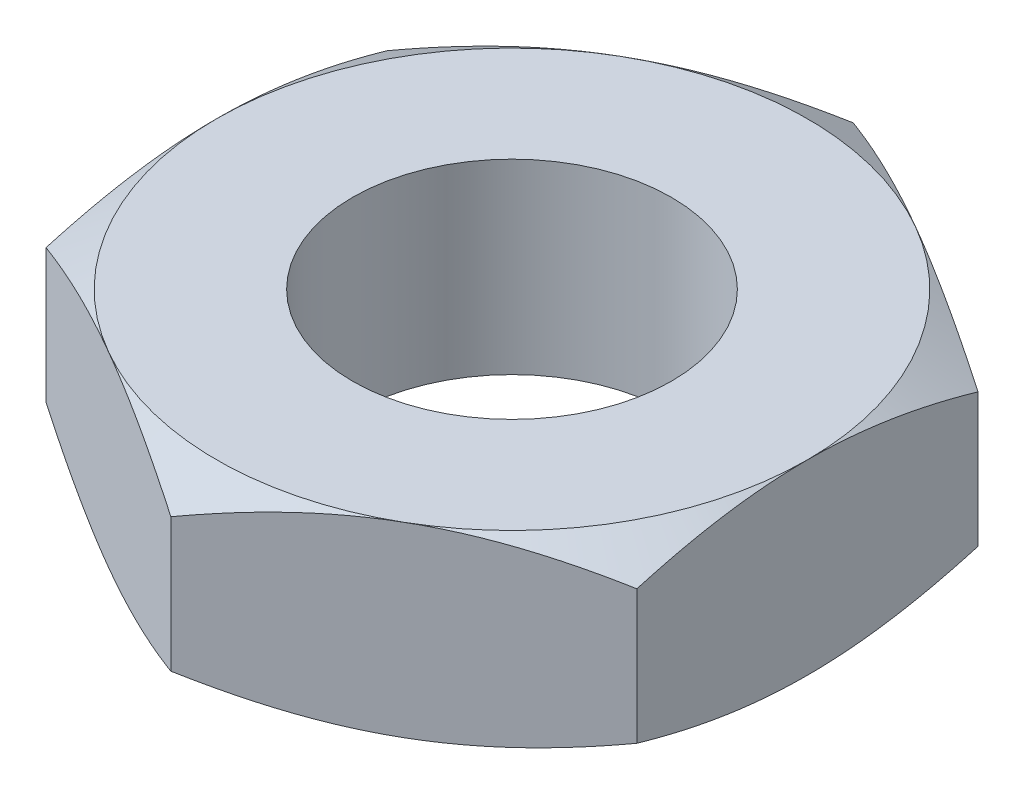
ISO-10303-21;
HEADER;
FILE_DESCRIPTION(('STEP AP214'),'2;1');
FILE_NAME('part.step','',(''),(''),'','','');
FILE_SCHEMA(('AUTOMOTIVE_DESIGN { 1 0 10303 214 1 1 1 1 }'));
ENDSEC;
DATA;
#1=APPLICATION_CONTEXT('core data for automotive mechanical design processes');
#2=APPLICATION_PROTOCOL_DEFINITION('international standard','automotive_design',2000,#1);
#3=PRODUCT_CONTEXT('',#1,'mechanical');
#4=PRODUCT('Part','Part','',(#3));
#5=PRODUCT_RELATED_PRODUCT_CATEGORY('part','',(#4));
#6=PRODUCT_DEFINITION_FORMATION('','',#4);
#7=PRODUCT_DEFINITION_CONTEXT('part definition',#1,'design');
#8=PRODUCT_DEFINITION('design','',#6,#7);
#9=PRODUCT_DEFINITION_SHAPE('','',#8);
#10=(LENGTH_UNIT() NAMED_UNIT(*) SI_UNIT(.MILLI.,.METRE.));
#11=(NAMED_UNIT(*) PLANE_ANGLE_UNIT() SI_UNIT($,.RADIAN.));
#12=(NAMED_UNIT(*) SI_UNIT($,.STERADIAN.) SOLID_ANGLE_UNIT());
#13=UNCERTAINTY_MEASURE_WITH_UNIT(LENGTH_MEASURE(1.E-05),#10,'distance_accuracy_value','');
#14=(GEOMETRIC_REPRESENTATION_CONTEXT(3) GLOBAL_UNCERTAINTY_ASSIGNED_CONTEXT((#13)) GLOBAL_UNIT_ASSIGNED_CONTEXT((#10,
#11,#12)) REPRESENTATION_CONTEXT('',''));
#15=CARTESIAN_POINT('',(0.,0.,0.));
#16=DIRECTION('',(0.,0.,1.));
#17=DIRECTION('',(1.,0.,0.));
#18=AXIS2_PLACEMENT_3D('',#15,#16,#17);
#19=CARTESIAN_POINT('',(0.,0.85359681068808,0.));
#20=DIRECTION('',(0.,1.,0.));
#21=DIRECTION('',(0.,0.,1.));
#22=AXIS2_PLACEMENT_3D('',#19,#20,#21);
#23=CONICAL_SURFACE('',#22,10.9784730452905,1.0471975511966);
#24=CARTESIAN_POINT('',(0.,0.84850577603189,-10.9696551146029));
#25=CARTESIAN_POINT('',(-0.386647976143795,0.719590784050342,-10.7464238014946));
#26=CARTESIAN_POINT('',(-0.77639236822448,0.601482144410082,-10.5214047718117));
#27=CARTESIAN_POINT('',(-1.55931671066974,0.393199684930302,-10.0693831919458));
#28=CARTESIAN_POINT('',(-1.95246935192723,0.302887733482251,-9.84239640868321));
#29=CARTESIAN_POINT('',(-2.545908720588,0.191999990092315,-9.49977402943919));
#30=CARTESIAN_POINT('',(-2.74447148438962,0.159120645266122,-9.38513376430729));
#31=CARTESIAN_POINT('',(-3.14254761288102,0.102205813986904,-9.15530440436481));
#32=CARTESIAN_POINT('',(-3.34206095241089,0.0781700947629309,-9.04011532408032));
#33=CARTESIAN_POINT('',(-3.74277620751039,0.0393648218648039,-8.80876226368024));
#34=CARTESIAN_POINT('',(-3.94398157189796,0.0246423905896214,-8.69259629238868));
#35=CARTESIAN_POINT('',(-4.34678800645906,0.00493960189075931,-8.46003588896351));
#36=CARTESIAN_POINT('',(-4.54838914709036,-3.88261459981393E-05,-8.3436414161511));
#37=CARTESIAN_POINT('',(-4.75,0.,-8.22724133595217));
#38=B_SPLINE_CURVE_WITH_KNOTS('',3,(#24,#25,#26,#27,#28,#29,#30,#31,#32,#33,#34,#35,#36,#37),
.UNSPECIFIED.,.F.,.F.,(4,2,2,2,2,2,4),(0.,1.39466965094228,2.78229242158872,3.47701423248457,
4.17171775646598,4.86990873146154,5.56823793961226),.UNSPECIFIED.);
#39=CARTESIAN_POINT('',(0.,0.848505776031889,-10.9696551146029));
#40=VERTEX_POINT('',#39);
#41=CARTESIAN_POINT('',(-4.75,0.,-8.22724133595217));
#42=VERTEX_POINT('',#41);
#43=EDGE_CURVE('E298',#40,#42,#38,.T.);
#44=ORIENTED_EDGE('',*,*,#43,.F.);
#45=CARTESIAN_POINT('',(4.75,0.,-8.22724133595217));
#46=CARTESIAN_POINT('',(4.54838914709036,-3.88261459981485E-05,-8.3436414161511));
#47=CARTESIAN_POINT('',(4.34678800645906,0.00493960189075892,-8.46003588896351));
#48=CARTESIAN_POINT('',(3.94398157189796,0.0246423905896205,-8.69259629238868));
#49=CARTESIAN_POINT('',(3.74277620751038,0.0393648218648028,-8.80876226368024));
#50=CARTESIAN_POINT('',(3.34206095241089,0.0781700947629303,-9.04011532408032));
#51=CARTESIAN_POINT('',(3.14254761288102,0.102205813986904,-9.15530440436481));
#52=CARTESIAN_POINT('',(2.74447148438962,0.159120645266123,-9.38513376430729));
#53=CARTESIAN_POINT('',(2.545908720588,0.191999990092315,-9.49977402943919));
#54=CARTESIAN_POINT('',(1.95246935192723,0.302887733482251,-9.84239640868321));
#55=CARTESIAN_POINT('',(1.55931671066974,0.393199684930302,-10.0693831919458));
#56=CARTESIAN_POINT('',(0.776392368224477,0.601482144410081,-10.5214047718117));
#57=CARTESIAN_POINT('',(0.386647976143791,0.719590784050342,-10.7464238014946));
#58=CARTESIAN_POINT('',(0.,0.848505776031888,-10.9696551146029));
#59=B_SPLINE_CURVE_WITH_KNOTS('',3,(#45,#46,#47,#48,#49,#50,#51,#52,#53,#54,#55,#56,#57,#58),
.UNSPECIFIED.,.F.,.F.,(4,2,2,2,2,2,4),(0.,0.698329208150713,1.39652018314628,2.09122370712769,
2.78594551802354,4.17356828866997,5.56823793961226),.UNSPECIFIED.);
#60=CARTESIAN_POINT('',(4.75,0.,-8.22724133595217));
#61=VERTEX_POINT('',#60);
#62=EDGE_CURVE('E142',#61,#40,#59,.T.);
#63=ORIENTED_EDGE('',*,*,#62,.F.);
#64=CARTESIAN_POINT('',(0.,0.,0.));
#65=DIRECTION('',(0.,1.,0.));
#66=DIRECTION('',(0.,0.,1.));
#67=AXIS2_PLACEMENT_3D('',#64,#65,#66);
#68=CIRCLE('',#67,9.5);
#69=EDGE_CURVE('E134',#42,#61,#68,.F.);
#70=ORIENTED_EDGE('',*,*,#69,.F.);
#71=EDGE_LOOP('',(#44,#63,#70));
#72=FACE_BOUND('',#71,.T.);
#73=ADVANCED_FACE('F16',(#72),#23,.T.);
#74=CARTESIAN_POINT('',(0.,0.85359681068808,0.));
#75=DIRECTION('',(0.,1.,0.));
#76=DIRECTION('',(0.,0.,1.));
#77=AXIS2_PLACEMENT_3D('',#74,#75,#76);
#78=CONICAL_SURFACE('',#77,10.9784730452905,1.0471975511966);
#79=CARTESIAN_POINT('',(-9.5,0.848505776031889,-5.48482755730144));
#80=CARTESIAN_POINT('',(-9.5,0.719590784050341,-5.03836493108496));
#81=CARTESIAN_POINT('',(-9.5,0.60148214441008,-4.5883268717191));
#82=CARTESIAN_POINT('',(-9.5,0.393199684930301,-3.68428371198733));
#83=CARTESIAN_POINT('',(-9.5,0.30288773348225,-3.23031014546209));
#84=CARTESIAN_POINT('',(-9.5,0.191999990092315,-2.54506538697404));
#85=CARTESIAN_POINT('',(-9.5,0.159120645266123,-2.31578485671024));
#86=CARTESIAN_POINT('',(-9.5,0.102205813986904,-1.8561261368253));
#87=CARTESIAN_POINT('',(-9.5,0.07817009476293,-1.62574797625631));
#88=CARTESIAN_POINT('',(-9.5,0.0393648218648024,-1.16304185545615));
#89=CARTESIAN_POINT('',(-9.5,0.0246423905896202,-0.930709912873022));
#90=CARTESIAN_POINT('',(-9.5,0.00493960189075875,-0.465589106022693));
#91=CARTESIAN_POINT('',(-9.5,-3.88261459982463E-05,-0.232800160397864));
#92=CARTESIAN_POINT('',(-9.5,0.,0.));
#93=B_SPLINE_CURVE_WITH_KNOTS('',3,(#79,#80,#81,#82,#83,#84,#85,#86,#87,#88,#89,#90,#91,#92),
.UNSPECIFIED.,.F.,.F.,(4,2,2,2,2,2,4),(0.,1.39466965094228,2.78229242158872,3.47701423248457,
4.17171775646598,4.86990873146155,5.56823793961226),.UNSPECIFIED.);
#94=CARTESIAN_POINT('',(-9.5,0.848505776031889,-5.48482755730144));
#95=VERTEX_POINT('',#94);
#96=CARTESIAN_POINT('',(-9.5,0.,0.));
#97=VERTEX_POINT('',#96);
#98=EDGE_CURVE('E299',#95,#97,#93,.T.);
#99=ORIENTED_EDGE('',*,*,#98,.F.);
#100=CARTESIAN_POINT('',(-4.75,0.,-8.22724133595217));
#101=CARTESIAN_POINT('',(-4.95161085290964,-3.88261459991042E-05,-8.11084125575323));
#102=CARTESIAN_POINT('',(-5.15321199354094,0.00493960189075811,-7.99444678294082));
#103=CARTESIAN_POINT('',(-5.55601842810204,0.0246423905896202,-7.76188637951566));
#104=CARTESIAN_POINT('',(-5.75722379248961,0.0393648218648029,-7.64572040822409));
#105=CARTESIAN_POINT('',(-6.1579390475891,0.0781700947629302,-7.41436734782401));
#106=CARTESIAN_POINT('',(-6.35745238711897,0.102205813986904,-7.29917826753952));
#107=CARTESIAN_POINT('',(-6.75552851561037,0.159120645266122,-7.06934890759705));
#108=CARTESIAN_POINT('',(-6.95409127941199,0.191999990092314,-6.95470864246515));
#109=CARTESIAN_POINT('',(-7.54753064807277,0.30288773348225,-6.61208626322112));
#110=CARTESIAN_POINT('',(-7.94068328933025,0.393199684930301,-6.3850994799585));
#111=CARTESIAN_POINT('',(-8.72360763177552,0.601482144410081,-5.93307790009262));
#112=CARTESIAN_POINT('',(-9.1133520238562,0.719590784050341,-5.70805887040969));
#113=CARTESIAN_POINT('',(-9.5,0.848505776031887,-5.48482755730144));
#114=B_SPLINE_CURVE_WITH_KNOTS('',3,(#100,#101,#102,#103,#104,#105,#106,#107,#108,#109,#110,
#111,#112,#113),.UNSPECIFIED.,.F.,.F.,(4,2,2,2,2,2,4),(0.,0.698329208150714,1.39652018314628,
2.09122370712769,2.78594551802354,4.17356828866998,5.56823793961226),.UNSPECIFIED.);
#115=EDGE_CURVE('E293',#42,#95,#114,.T.);
#116=ORIENTED_EDGE('',*,*,#115,.F.);
#117=CARTESIAN_POINT('',(0.,0.,0.));
#118=DIRECTION('',(0.,1.,0.));
#119=DIRECTION('',(0.,0.,1.));
#120=AXIS2_PLACEMENT_3D('',#117,#118,#119);
#121=CIRCLE('',#120,9.5);
#122=EDGE_CURVE('E136',#97,#42,#121,.F.);
#123=ORIENTED_EDGE('',*,*,#122,.F.);
#124=EDGE_LOOP('',(#99,#116,#123));
#125=FACE_BOUND('',#124,.T.);
#126=ADVANCED_FACE('F193',(#125),#78,.T.);
#127=CARTESIAN_POINT('',(0.,0.853596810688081,0.));
#128=DIRECTION('',(0.,1.,0.));
#129=DIRECTION('',(-1.,0.,0.));
#130=AXIS2_PLACEMENT_3D('',#127,#128,#129);
#131=CONICAL_SURFACE('',#130,10.9784730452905,1.0471975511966);
#132=CARTESIAN_POINT('',(-9.5,0.84850577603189,5.48482755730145));
#133=CARTESIAN_POINT('',(-9.1133520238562,0.719590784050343,5.70805887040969));
#134=CARTESIAN_POINT('',(-8.72360763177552,0.601482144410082,5.93307790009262));
#135=CARTESIAN_POINT('',(-7.94068328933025,0.393199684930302,6.38509947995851));
#136=CARTESIAN_POINT('',(-7.54753064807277,0.302887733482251,6.61208626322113));
#137=CARTESIAN_POINT('',(-6.95409127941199,0.191999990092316,6.95470864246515));
#138=CARTESIAN_POINT('',(-6.75552851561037,0.159120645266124,7.06934890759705));
#139=CARTESIAN_POINT('',(-6.35745238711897,0.102205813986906,7.29917826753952));
#140=CARTESIAN_POINT('',(-6.1579390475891,0.0781700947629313,7.41436734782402));
#141=CARTESIAN_POINT('',(-5.75722379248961,0.0393648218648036,7.6457204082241));
#142=CARTESIAN_POINT('',(-5.55601842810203,0.0246423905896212,7.76188637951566));
#143=CARTESIAN_POINT('',(-5.15321199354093,0.00493960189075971,7.99444678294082));
#144=CARTESIAN_POINT('',(-4.95161085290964,-3.88261459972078E-05,8.11084125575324));
#145=CARTESIAN_POINT('',(-4.74999999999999,0.,8.22724133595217));
#146=B_SPLINE_CURVE_WITH_KNOTS('',3,(#132,#133,#134,#135,#136,#137,#138,#139,#140,#141,#142,
#143,#144,#145),.UNSPECIFIED.,.F.,.F.,(4,2,2,2,2,2,4),(0.,1.39466965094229,2.78229242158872,
3.47701423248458,4.17171775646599,4.86990873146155,5.56823793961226),.UNSPECIFIED.);
#147=CARTESIAN_POINT('',(-9.5,0.84850577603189,5.48482755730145));
#148=VERTEX_POINT('',#147);
#149=CARTESIAN_POINT('',(-4.75,0.,8.22724133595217));
#150=VERTEX_POINT('',#149);
#151=EDGE_CURVE('E204',#148,#150,#146,.T.);
#152=ORIENTED_EDGE('',*,*,#151,.F.);
#153=CARTESIAN_POINT('',(-9.5,0.,0.));
#154=CARTESIAN_POINT('',(-9.5,-3.88261459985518E-05,0.232800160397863));
#155=CARTESIAN_POINT('',(-9.5,0.00493960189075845,0.465589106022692));
#156=CARTESIAN_POINT('',(-9.5,0.02464239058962,0.930709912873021));
#157=CARTESIAN_POINT('',(-9.5,0.0393648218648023,1.16304185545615));
#158=CARTESIAN_POINT('',(-9.5,0.07817009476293,1.62574797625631));
#159=CARTESIAN_POINT('',(-9.5,0.102205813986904,1.8561261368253));
#160=CARTESIAN_POINT('',(-9.5,0.159120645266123,2.31578485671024));
#161=CARTESIAN_POINT('',(-9.5,0.191999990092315,2.54506538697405));
#162=CARTESIAN_POINT('',(-9.5,0.30288773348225,3.23031014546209));
#163=CARTESIAN_POINT('',(-9.5,0.393199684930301,3.68428371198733));
#164=CARTESIAN_POINT('',(-9.5,0.601482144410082,4.5883268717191));
#165=CARTESIAN_POINT('',(-9.5,0.719590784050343,5.03836493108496));
#166=CARTESIAN_POINT('',(-9.5,0.84850577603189,5.48482755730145));
#167=B_SPLINE_CURVE_WITH_KNOTS('',3,(#153,#154,#155,#156,#157,#158,#159,#160,#161,#162,#163,
#164,#165,#166),.UNSPECIFIED.,.F.,.F.,(4,2,2,2,2,2,4),(0.,0.698329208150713,1.39652018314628,
2.09122370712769,2.78594551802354,4.17356828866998,5.56823793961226),.UNSPECIFIED.);
#168=EDGE_CURVE('E198',#97,#148,#167,.T.);
#169=ORIENTED_EDGE('',*,*,#168,.F.);
#170=CARTESIAN_POINT('',(0.,0.,0.));
#171=DIRECTION('',(0.,1.,0.));
#172=DIRECTION('',(-1.,0.,0.));
#173=AXIS2_PLACEMENT_3D('',#170,#171,#172);
#174=CIRCLE('',#173,9.5);
#175=EDGE_CURVE('E144',#150,#97,#174,.F.);
#176=ORIENTED_EDGE('',*,*,#175,.F.);
#177=EDGE_LOOP('',(#152,#169,#176));
#178=FACE_BOUND('',#177,.T.);
#179=ADVANCED_FACE('F188',(#178),#131,.T.);
#180=CARTESIAN_POINT('',(0.,0.853596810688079,0.));
#181=DIRECTION('',(0.,1.,0.));
#182=DIRECTION('',(-1.,0.,0.));
#183=AXIS2_PLACEMENT_3D('',#180,#181,#182);
#184=CONICAL_SURFACE('',#183,10.9784730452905,1.0471975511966);
#185=CARTESIAN_POINT('',(0.,0.,0.));
#186=DIRECTION('',(0.,1.,0.));
#187=DIRECTION('',(-1.,0.,0.));
#188=AXIS2_PLACEMENT_3D('',#185,#186,#187);
#189=CIRCLE('',#188,9.5);
#190=CARTESIAN_POINT('',(4.75,0.,8.22724133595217));
#191=VERTEX_POINT('',#190);
#192=EDGE_CURVE('E117',#191,#150,#189,.F.);
#193=ORIENTED_EDGE('',*,*,#192,.F.);
#194=CARTESIAN_POINT('',(0.,0.848505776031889,10.9696551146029));
#195=CARTESIAN_POINT('',(0.386647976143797,0.719590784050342,10.7464238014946));
#196=CARTESIAN_POINT('',(0.776392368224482,0.601482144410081,10.5214047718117));
#197=CARTESIAN_POINT('',(1.55931671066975,0.393199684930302,10.0693831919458));
#198=CARTESIAN_POINT('',(1.95246935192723,0.302887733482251,9.84239640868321));
#199=CARTESIAN_POINT('',(2.54590872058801,0.191999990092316,9.49977402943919));
#200=CARTESIAN_POINT('',(2.74447148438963,0.159120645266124,9.38513376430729));
#201=CARTESIAN_POINT('',(3.14254761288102,0.102205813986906,9.15530440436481));
#202=CARTESIAN_POINT('',(3.3420609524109,0.0781700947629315,9.04011532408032));
#203=CARTESIAN_POINT('',(3.74277620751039,0.039364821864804,8.80876226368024));
#204=CARTESIAN_POINT('',(3.94398157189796,0.0246423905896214,8.69259629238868));
#205=CARTESIAN_POINT('',(4.34678800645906,0.00493960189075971,8.46003588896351));
#206=CARTESIAN_POINT('',(4.54838914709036,-3.8826145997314E-05,8.3436414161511));
#207=CARTESIAN_POINT('',(4.75,0.,8.22724133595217));
#208=B_SPLINE_CURVE_WITH_KNOTS('',3,(#194,#195,#196,#197,#198,#199,#200,#201,#202,#203,#204,
#205,#206,#207),.UNSPECIFIED.,.F.,.F.,(4,2,2,2,2,2,4),(0.,1.39466965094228,2.78229242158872,
3.47701423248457,4.17171775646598,4.86990873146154,5.56823793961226),.UNSPECIFIED.);
#209=CARTESIAN_POINT('',(0.,0.848505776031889,10.9696551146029));
#210=VERTEX_POINT('',#209);
#211=EDGE_CURVE('E159',#210,#191,#208,.T.);
#212=ORIENTED_EDGE('',*,*,#211,.F.);
#213=CARTESIAN_POINT('',(-4.74999999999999,0.,8.22724133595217));
#214=CARTESIAN_POINT('',(-4.54838914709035,-3.88261459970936E-05,8.3436414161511));
#215=CARTESIAN_POINT('',(-4.34678800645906,0.00493960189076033,8.46003588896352));
#216=CARTESIAN_POINT('',(-3.94398157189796,0.0246423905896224,8.69259629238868));
#217=CARTESIAN_POINT('',(-3.74277620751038,0.0393648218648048,8.80876226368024));
#218=CARTESIAN_POINT('',(-3.34206095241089,0.0781700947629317,9.04011532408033));
#219=CARTESIAN_POINT('',(-3.14254761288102,0.102205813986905,9.15530440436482));
#220=CARTESIAN_POINT('',(-2.74447148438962,0.159120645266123,9.38513376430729));
#221=CARTESIAN_POINT('',(-2.545908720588,0.191999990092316,9.49977402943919));
#222=CARTESIAN_POINT('',(-1.95246935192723,0.302887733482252,9.84239640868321));
#223=CARTESIAN_POINT('',(-1.55931671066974,0.393199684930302,10.0693831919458));
#224=CARTESIAN_POINT('',(-0.776392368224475,0.601482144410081,10.5214047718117));
#225=CARTESIAN_POINT('',(-0.386647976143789,0.719590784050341,10.7464238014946));
#226=CARTESIAN_POINT('',(0.,0.848505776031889,10.9696551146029));
#227=B_SPLINE_CURVE_WITH_KNOTS('',3,(#213,#214,#215,#216,#217,#218,#219,#220,#221,#222,#223,
#224,#225,#226),.UNSPECIFIED.,.F.,.F.,(4,2,2,2,2,2,4),(0.,0.698329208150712,1.39652018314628,
2.09122370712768,2.78594551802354,4.17356828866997,5.56823793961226),.UNSPECIFIED.);
#228=EDGE_CURVE('E161',#150,#210,#227,.T.);
#229=ORIENTED_EDGE('',*,*,#228,.F.);
#230=EDGE_LOOP('',(#193,#212,#229));
#231=FACE_BOUND('',#230,.T.);
#232=ADVANCED_FACE('F158',(#231),#184,.T.);
#233=CARTESIAN_POINT('',(0.,0.853596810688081,0.));
#234=DIRECTION('',(0.,1.,0.));
#235=DIRECTION('',(-1.,0.,0.));
#236=AXIS2_PLACEMENT_3D('',#233,#234,#235);
#237=CONICAL_SURFACE('',#236,10.9784730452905,1.0471975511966);
#238=CARTESIAN_POINT('',(9.5,0.84850577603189,5.48482755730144));
#239=CARTESIAN_POINT('',(9.5,0.719590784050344,5.03836493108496));
#240=CARTESIAN_POINT('',(9.5,0.601482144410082,4.5883268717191));
#241=CARTESIAN_POINT('',(9.5,0.393199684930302,3.68428371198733));
#242=CARTESIAN_POINT('',(9.5,0.302887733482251,3.23031014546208));
#243=CARTESIAN_POINT('',(9.5,0.191999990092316,2.54506538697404));
#244=CARTESIAN_POINT('',(9.5,0.159120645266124,2.31578485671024));
#245=CARTESIAN_POINT('',(9.5,0.102205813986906,1.8561261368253));
#246=CARTESIAN_POINT('',(9.5,0.0781700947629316,1.62574797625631));
#247=CARTESIAN_POINT('',(9.5,0.0393648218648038,1.16304185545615));
#248=CARTESIAN_POINT('',(9.5,0.0246423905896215,0.930709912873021));
#249=CARTESIAN_POINT('',(9.5,0.0049396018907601,0.465589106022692));
#250=CARTESIAN_POINT('',(9.5,-3.88261459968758E-05,0.232800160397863));
#251=CARTESIAN_POINT('',(9.5,0.,0.));
#252=B_SPLINE_CURVE_WITH_KNOTS('',3,(#238,#239,#240,#241,#242,#243,#244,#245,#246,#247,#248,
#249,#250,#251),.UNSPECIFIED.,.F.,.F.,(4,2,2,2,2,2,4),(0.,1.39466965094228,2.78229242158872,
3.47701423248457,4.17171775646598,4.86990873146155,5.56823793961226),.UNSPECIFIED.);
#253=CARTESIAN_POINT('',(9.5,0.84850577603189,5.48482755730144));
#254=VERTEX_POINT('',#253);
#255=CARTESIAN_POINT('',(9.5,0.,0.));
#256=VERTEX_POINT('',#255);
#257=EDGE_CURVE('E112',#254,#256,#252,.T.);
#258=ORIENTED_EDGE('',*,*,#257,.F.);
#259=CARTESIAN_POINT('',(4.75,0.,8.22724133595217));
#260=CARTESIAN_POINT('',(4.95161085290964,-3.88261459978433E-05,8.11084125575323));
#261=CARTESIAN_POINT('',(5.15321199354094,0.00493960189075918,7.99444678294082));
#262=CARTESIAN_POINT('',(5.55601842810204,0.0246423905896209,7.76188637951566));
#263=CARTESIAN_POINT('',(5.75722379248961,0.0393648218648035,7.64572040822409));
#264=CARTESIAN_POINT('',(6.15793904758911,0.0781700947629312,7.41436734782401));
#265=CARTESIAN_POINT('',(6.35745238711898,0.102205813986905,7.29917826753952));
#266=CARTESIAN_POINT('',(6.75552851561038,0.159120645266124,7.06934890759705));
#267=CARTESIAN_POINT('',(6.954091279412,0.191999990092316,6.95470864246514));
#268=CARTESIAN_POINT('',(7.54753064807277,0.302887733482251,6.61208626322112));
#269=CARTESIAN_POINT('',(7.94068328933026,0.393199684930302,6.3850994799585));
#270=CARTESIAN_POINT('',(8.72360763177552,0.601482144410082,5.93307790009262));
#271=CARTESIAN_POINT('',(9.11335202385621,0.719590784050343,5.70805887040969));
#272=CARTESIAN_POINT('',(9.5,0.84850577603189,5.48482755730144));
#273=B_SPLINE_CURVE_WITH_KNOTS('',3,(#259,#260,#261,#262,#263,#264,#265,#266,#267,#268,#269,
#270,#271,#272),.UNSPECIFIED.,.F.,.F.,(4,2,2,2,2,2,4),(0.,0.698329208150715,1.39652018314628,
2.09122370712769,2.78594551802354,4.17356828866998,5.56823793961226),.UNSPECIFIED.);
#274=EDGE_CURVE('E114',#191,#254,#273,.T.);
#275=ORIENTED_EDGE('',*,*,#274,.F.);
#276=CARTESIAN_POINT('',(0.,0.,0.));
#277=DIRECTION('',(0.,1.,0.));
#278=DIRECTION('',(-1.,0.,0.));
#279=AXIS2_PLACEMENT_3D('',#276,#277,#278);
#280=CIRCLE('',#279,9.5);
#281=EDGE_CURVE('E109',#256,#191,#280,.F.);
#282=ORIENTED_EDGE('',*,*,#281,.F.);
#283=EDGE_LOOP('',(#258,#275,#282));
#284=FACE_BOUND('',#283,.T.);
#285=ADVANCED_FACE('F111',(#284),#237,.T.);
#286=CARTESIAN_POINT('',(0.,0.853596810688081,0.));
#287=DIRECTION('',(0.,1.,0.));
#288=DIRECTION('',(-1.,0.,0.));
#289=AXIS2_PLACEMENT_3D('',#286,#287,#288);
#290=CONICAL_SURFACE('',#289,10.9784730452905,1.0471975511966);
#291=CARTESIAN_POINT('',(9.5,0.848505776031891,-5.48482755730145));
#292=CARTESIAN_POINT('',(9.11335202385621,0.719590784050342,-5.70805887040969));
#293=CARTESIAN_POINT('',(8.72360763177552,0.601482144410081,-5.93307790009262));
#294=CARTESIAN_POINT('',(7.94068328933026,0.393199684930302,-6.3850994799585));
#295=CARTESIAN_POINT('',(7.54753064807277,0.302887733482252,-6.61208626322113));
#296=CARTESIAN_POINT('',(6.95409127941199,0.191999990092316,-6.95470864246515));
#297=CARTESIAN_POINT('',(6.75552851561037,0.159120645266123,-7.06934890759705));
#298=CARTESIAN_POINT('',(6.35745238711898,0.102205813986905,-7.29917826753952));
#299=CARTESIAN_POINT('',(6.1579390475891,0.0781700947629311,-7.41436734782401));
#300=CARTESIAN_POINT('',(5.75722379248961,0.0393648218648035,-7.64572040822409));
#301=CARTESIAN_POINT('',(5.55601842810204,0.0246423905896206,-7.76188637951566));
#302=CARTESIAN_POINT('',(5.15321199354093,0.00493960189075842,-7.99444678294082));
#303=CARTESIAN_POINT('',(4.95161085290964,-3.88261459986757E-05,-8.11084125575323));
#304=CARTESIAN_POINT('',(4.75,0.,-8.22724133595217));
#305=B_SPLINE_CURVE_WITH_KNOTS('',3,(#291,#292,#293,#294,#295,#296,#297,#298,#299,#300,#301,
#302,#303,#304),.UNSPECIFIED.,.F.,.F.,(4,2,2,2,2,2,4),(0.,1.39466965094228,2.78229242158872,
3.47701423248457,4.17171775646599,4.86990873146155,5.56823793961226),.UNSPECIFIED.);
#306=CARTESIAN_POINT('',(9.5,0.84850577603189,-5.48482755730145));
#307=VERTEX_POINT('',#306);
#308=EDGE_CURVE('E126',#307,#61,#305,.T.);
#309=ORIENTED_EDGE('',*,*,#308,.F.);
#310=CARTESIAN_POINT('',(9.5,0.,0.));
#311=CARTESIAN_POINT('',(9.5,-3.88261459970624E-05,-0.232800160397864));
#312=CARTESIAN_POINT('',(9.5,0.00493960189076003,-0.465589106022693));
#313=CARTESIAN_POINT('',(9.5,0.0246423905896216,-0.930709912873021));
#314=CARTESIAN_POINT('',(9.5,0.0393648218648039,-1.16304185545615));
#315=CARTESIAN_POINT('',(9.5,0.0781700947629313,-1.62574797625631));
#316=CARTESIAN_POINT('',(9.5,0.102205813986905,-1.8561261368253));
#317=CARTESIAN_POINT('',(9.5,0.159120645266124,-2.31578485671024));
#318=CARTESIAN_POINT('',(9.5,0.191999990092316,-2.54506538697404));
#319=CARTESIAN_POINT('',(9.5,0.302887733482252,-3.23031014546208));
#320=CARTESIAN_POINT('',(9.5,0.393199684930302,-3.68428371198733));
#321=CARTESIAN_POINT('',(9.5,0.601482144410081,-4.5883268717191));
#322=CARTESIAN_POINT('',(9.5,0.719590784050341,-5.03836493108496));
#323=CARTESIAN_POINT('',(9.5,0.848505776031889,-5.48482755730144));
#324=B_SPLINE_CURVE_WITH_KNOTS('',3,(#310,#311,#312,#313,#314,#315,#316,#317,#318,#319,#320,
#321,#322,#323),.UNSPECIFIED.,.F.,.F.,(4,2,2,2,2,2,4),(0.,0.698329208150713,1.39652018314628,
2.09122370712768,2.78594551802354,4.17356828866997,5.56823793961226),.UNSPECIFIED.);
#325=EDGE_CURVE('E121',#256,#307,#324,.T.);
#326=ORIENTED_EDGE('',*,*,#325,.F.);
#327=CARTESIAN_POINT('',(0.,0.,0.));
#328=DIRECTION('',(0.,1.,0.));
#329=DIRECTION('',(-1.,0.,0.));
#330=AXIS2_PLACEMENT_3D('',#327,#328,#329);
#331=CIRCLE('',#330,9.5);
#332=EDGE_CURVE('E20',#61,#256,#331,.F.);
#333=ORIENTED_EDGE('',*,*,#332,.F.);
#334=EDGE_LOOP('',(#309,#326,#333));
#335=FACE_BOUND('',#334,.T.);
#336=ADVANCED_FACE('F125',(#335),#290,.T.);
#337=CARTESIAN_POINT('',(0.,0.,0.));
#338=DIRECTION('',(0.,-1.,0.));
#339=DIRECTION('',(0.,0.,-1.));
#340=AXIS2_PLACEMENT_3D('',#337,#338,#339);
#341=PLANE('',#340);
#342=ORIENTED_EDGE('',*,*,#122,.T.);
#343=ORIENTED_EDGE('',*,*,#69,.T.);
#344=ORIENTED_EDGE('',*,*,#332,.T.);
#345=ORIENTED_EDGE('',*,*,#281,.T.);
#346=ORIENTED_EDGE('',*,*,#192,.T.);
#347=ORIENTED_EDGE('',*,*,#175,.T.);
#348=EDGE_LOOP('',(#342,#343,#344,#345,#346,#347));
#349=FACE_BOUND('',#348,.T.);
#350=CARTESIAN_POINT('',(0.,0.,0.));
#351=DIRECTION('',(0.,-1.,0.));
#352=DIRECTION('',(0.,0.,-1.));
#353=AXIS2_PLACEMENT_3D('',#350,#351,#352);
#354=CIRCLE('',#353,5.125);
#355=CARTESIAN_POINT('',(0.,0.,-5.125));
#356=VERTEX_POINT('',#355);
#357=EDGE_CURVE('E128',#356,#356,#354,.F.);
#358=ORIENTED_EDGE('',*,*,#357,.T.);
#359=EDGE_LOOP('',(#358));
#360=FACE_BOUND('',#359,.T.);
#361=ADVANCED_FACE('F132',(#349,#360),#341,.T.);
#362=CARTESIAN_POINT('',(9.5,0.,-5.48482755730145));
#363=DIRECTION('',(0.5,0.,-0.866025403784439));
#364=DIRECTION('',(-0.866025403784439,0.,-0.5));
#365=AXIS2_PLACEMENT_3D('',#362,#363,#364);
#366=PLANE('',#365);
#367=ORIENTED_EDGE('',*,*,#308,.T.);
#368=ORIENTED_EDGE('',*,*,#62,.T.);
#369=DIRECTION('',(0.,1.,0.));
#370=VECTOR('',#369,1.);
#371=CARTESIAN_POINT('',(0.,0.,-10.9696551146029));
#372=LINE('',#371,#370);
#373=CARTESIAN_POINT('',(0.,5.15149422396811,-10.9696551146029));
#374=VERTEX_POINT('',#373);
#375=EDGE_CURVE('E306',#374,#40,#372,.F.);
#376=ORIENTED_EDGE('',*,*,#375,.F.);
#377=CARTESIAN_POINT('',(4.75,6.,-8.22724133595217));
#378=CARTESIAN_POINT('',(4.54838914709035,6.000038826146,-8.3436414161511));
#379=CARTESIAN_POINT('',(4.34678800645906,5.99506039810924,-8.46003588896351));
#380=CARTESIAN_POINT('',(3.94398157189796,5.97535760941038,-8.69259629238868));
#381=CARTESIAN_POINT('',(3.74277620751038,5.9606351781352,-8.80876226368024));
#382=CARTESIAN_POINT('',(3.34206095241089,5.92182990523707,-9.04011532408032));
#383=CARTESIAN_POINT('',(3.14254761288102,5.8977941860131,-9.15530440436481));
#384=CARTESIAN_POINT('',(2.74447148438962,5.84087935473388,-9.38513376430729));
#385=CARTESIAN_POINT('',(2.545908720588,5.80800000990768,-9.49977402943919));
#386=CARTESIAN_POINT('',(1.95246935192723,5.69711226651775,-9.84239640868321));
#387=CARTESIAN_POINT('',(1.55931671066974,5.6068003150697,-10.0693831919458));
#388=CARTESIAN_POINT('',(0.776392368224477,5.39851785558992,-10.5214047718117));
#389=CARTESIAN_POINT('',(0.386647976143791,5.28040921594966,-10.7464238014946));
#390=CARTESIAN_POINT('',(0.,5.15149422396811,-10.9696551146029));
#391=B_SPLINE_CURVE_WITH_KNOTS('',3,(#377,#378,#379,#380,#381,#382,#383,#384,#385,#386,#387,
#388,#389,#390),.UNSPECIFIED.,.F.,.F.,(4,2,2,2,2,2,4),(0.,0.698329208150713,1.39652018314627,
2.09122370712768,2.78594551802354,4.17356828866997,5.56823793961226),.UNSPECIFIED.);
#392=CARTESIAN_POINT('',(4.75,6.,-8.22724133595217));
#393=VERTEX_POINT('',#392);
#394=EDGE_CURVE('E395',#393,#374,#391,.T.);
#395=ORIENTED_EDGE('',*,*,#394,.F.);
#396=CARTESIAN_POINT('',(9.50000002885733,5.151494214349,-5.48482754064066));
#397=CARTESIAN_POINT('',(9.11335205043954,5.280409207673,-5.7080588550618));
#398=CARTESIAN_POINT('',(8.72360765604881,5.39851784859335,-5.93307788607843));
#399=CARTESIAN_POINT('',(7.9406833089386,5.60680031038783,-6.38509946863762));
#400=CARTESIAN_POINT('',(7.54753066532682,5.69711226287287,-6.6120862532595));
#401=CARTESIAN_POINT('',(6.95409129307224,5.80800000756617,-6.9547086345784));
#402=CARTESIAN_POINT('',(6.75552852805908,5.84087935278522,-7.06934890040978));
#403=CARTESIAN_POINT('',(6.35745239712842,5.89779418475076,-7.29917826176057));
#404=CARTESIAN_POINT('',(6.15793905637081,5.92182990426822,-7.41436734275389));
#405=CARTESIAN_POINT('',(5.75722379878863,5.960635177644,-7.64572040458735));
#406=CARTESIAN_POINT('',(5.55601843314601,5.97535760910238,-7.76188637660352));
#407=CARTESIAN_POINT('',(5.15321199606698,5.99506039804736,-7.99444678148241));
#408=CARTESIAN_POINT('',(4.95161085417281,6.00003882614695,-8.11084125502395));
#409=CARTESIAN_POINT('',(4.75,6.,-8.22724133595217));
#410=B_SPLINE_CURVE_WITH_KNOTS('',3,(#396,#397,#398,#399,#400,#401,#402,#403,#404,#405,#406,
#407,#408,#409),.UNSPECIFIED.,.F.,.F.,(4,2,2,2,2,2,4),(0.,1.39466965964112,2.78229243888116,
3.4770142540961,4.17171778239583,4.86990876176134,5.56823797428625),.UNSPECIFIED.);
#411=CARTESIAN_POINT('',(9.50000001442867,5.15149421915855,-5.48482754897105));
#412=VERTEX_POINT('',#411);
#413=EDGE_CURVE('E392',#412,#393,#410,.T.);
#414=ORIENTED_EDGE('',*,*,#413,.F.);
#415=DIRECTION('',(0.,1.,0.));
#416=VECTOR('',#415,1.);
#417=CARTESIAN_POINT('',(9.5,0.,-5.48482755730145));
#418=LINE('',#417,#416);
#419=EDGE_CURVE('E165',#307,#412,#418,.T.);
#420=ORIENTED_EDGE('',*,*,#419,.F.);
#421=EDGE_LOOP('',(#367,#368,#376,#395,#414,#420));
#422=FACE_BOUND('',#421,.T.);
#423=ADVANCED_FACE('F284',(#422),#366,.T.);
#424=CARTESIAN_POINT('',(0.,0.,-10.9696551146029));
#425=DIRECTION('',(-0.5,0.,-0.866025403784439));
#426=DIRECTION('',(-0.866025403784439,0.,0.5));
#427=AXIS2_PLACEMENT_3D('',#424,#425,#426);
#428=PLANE('',#427);
#429=ORIENTED_EDGE('',*,*,#43,.T.);
#430=ORIENTED_EDGE('',*,*,#115,.T.);
#431=DIRECTION('',(0.,1.,0.));
#432=VECTOR('',#431,1.);
#433=CARTESIAN_POINT('',(-9.5,0.,-5.48482755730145));
#434=LINE('',#433,#432);
#435=CARTESIAN_POINT('',(-9.5,5.15149421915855,-5.48482757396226));
#436=VERTEX_POINT('',#435);
#437=EDGE_CURVE('E297',#436,#95,#434,.F.);
#438=ORIENTED_EDGE('',*,*,#437,.F.);
#439=CARTESIAN_POINT('',(-4.75,6.,-8.22724133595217));
#440=CARTESIAN_POINT('',(-4.9516108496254,6.00003882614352,-8.11084125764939));
#441=CARTESIAN_POINT('',(-5.15321198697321,5.99506039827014,-7.9944467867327));
#442=CARTESIAN_POINT('',(-5.5560184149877,5.97535761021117,-7.76188638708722));
#443=CARTESIAN_POINT('',(-5.75722377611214,5.9606351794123,-7.64572041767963));
#444=CARTESIAN_POINT('',(-6.15793902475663,5.92182990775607,-7.41436736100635));
#445=CARTESIAN_POINT('',(-6.3574523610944,5.89779418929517,-7.29917828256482));
#446=CARTESIAN_POINT('',(-6.75552848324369,5.8408793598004,-7.06934892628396));
#447=CARTESIAN_POINT('',(-6.95409124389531,5.80800001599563,-6.95470866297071));
#448=CARTESIAN_POINT('',(-7.54753060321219,5.69711227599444,-6.61208628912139));
#449=CARTESIAN_POINT('',(-7.9406832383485,5.60680032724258,-6.38509950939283));
#450=CARTESIAN_POINT('',(-8.72360756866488,5.39851787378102,-5.93307793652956));
#451=CARTESIAN_POINT('',(-9.11335195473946,5.280409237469,-5.70805891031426));
#452=CARTESIAN_POINT('',(-9.49999992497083,5.15149424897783,-5.48482760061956));
#453=B_SPLINE_CURVE_WITH_KNOTS('',3,(#439,#440,#441,#442,#443,#444,#445,#446,#447,#448,#449,
#450,#451,#452),.UNSPECIFIED.,.F.,.F.,(4,2,2,2,2,2,4),(0.,0.698329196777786,1.39652016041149,
2.09122367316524,2.78594547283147,4.1735682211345,5.56823784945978),.UNSPECIFIED.);
#454=CARTESIAN_POINT('',(-4.75,6.,-8.22724133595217));
#455=VERTEX_POINT('',#454);
#456=EDGE_CURVE('E270',#455,#436,#453,.T.);
#457=ORIENTED_EDGE('',*,*,#456,.F.);
#458=CARTESIAN_POINT('',(0.,5.15149422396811,-10.9696551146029));
#459=CARTESIAN_POINT('',(-0.386647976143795,5.28040921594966,-10.7464238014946));
#460=CARTESIAN_POINT('',(-0.77639236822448,5.39851785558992,-10.5214047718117));
#461=CARTESIAN_POINT('',(-1.55931671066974,5.6068003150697,-10.0693831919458));
#462=CARTESIAN_POINT('',(-1.95246935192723,5.69711226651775,-9.84239640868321));
#463=CARTESIAN_POINT('',(-2.54590872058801,5.80800000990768,-9.49977402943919));
#464=CARTESIAN_POINT('',(-2.74447148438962,5.84087935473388,-9.38513376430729));
#465=CARTESIAN_POINT('',(-3.14254761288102,5.89779418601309,-9.15530440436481));
#466=CARTESIAN_POINT('',(-3.34206095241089,5.92182990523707,-9.04011532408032));
#467=CARTESIAN_POINT('',(-3.74277620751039,5.9606351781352,-8.80876226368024));
#468=CARTESIAN_POINT('',(-3.94398157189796,5.97535760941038,-8.69259629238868));
#469=CARTESIAN_POINT('',(-4.34678800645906,5.99506039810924,-8.46003588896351));
#470=CARTESIAN_POINT('',(-4.54838914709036,6.000038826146,-8.3436414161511));
#471=CARTESIAN_POINT('',(-4.75,6.,-8.22724133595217));
#472=B_SPLINE_CURVE_WITH_KNOTS('',3,(#458,#459,#460,#461,#462,#463,#464,#465,#466,#467,#468,
#469,#470,#471),.UNSPECIFIED.,.F.,.F.,(4,2,2,2,2,2,4),(0.,1.39466965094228,2.78229242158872,
3.47701423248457,4.17171775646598,4.86990873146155,5.56823793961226),.UNSPECIFIED.);
#473=EDGE_CURVE('E276',#374,#455,#472,.T.);
#474=ORIENTED_EDGE('',*,*,#473,.F.);
#475=ORIENTED_EDGE('',*,*,#375,.T.);
#476=EDGE_LOOP('',(#429,#430,#438,#457,#474,#475));
#477=FACE_BOUND('',#476,.T.);
#478=ADVANCED_FACE('F281',(#477),#428,.T.);
#479=CARTESIAN_POINT('',(-9.5,0.,-5.48482755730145));
#480=DIRECTION('',(-1.,0.,0.));
#481=DIRECTION('',(0.,0.,1.));
#482=AXIS2_PLACEMENT_3D('',#479,#480,#481);
#483=PLANE('',#482);
#484=ORIENTED_EDGE('',*,*,#98,.T.);
#485=ORIENTED_EDGE('',*,*,#168,.T.);
#486=DIRECTION('',(0.,1.,0.));
#487=VECTOR('',#486,1.);
#488=CARTESIAN_POINT('',(-9.5,0.,5.48482755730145));
#489=LINE('',#488,#487);
#490=CARTESIAN_POINT('',(-9.50000001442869,5.15149421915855,5.48482754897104));
#491=VERTEX_POINT('',#490);
#492=EDGE_CURVE('E209',#491,#148,#489,.F.);
#493=ORIENTED_EDGE('',*,*,#492,.F.);
#494=CARTESIAN_POINT('',(-9.5,6.,0.));
#495=CARTESIAN_POINT('',(-9.5,6.00003882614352,0.232800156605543));
#496=CARTESIAN_POINT('',(-9.5,5.99506039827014,0.46558909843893));
#497=CARTESIAN_POINT('',(-9.5,5.97535761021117,0.930709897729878));
#498=CARTESIAN_POINT('',(-9.5,5.9606351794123,1.16304183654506));
#499=CARTESIAN_POINT('',(-9.5,5.92182990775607,1.62574794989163));
#500=CARTESIAN_POINT('',(-9.5,5.89779418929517,1.85612610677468));
#501=CARTESIAN_POINT('',(-9.5,5.8408793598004,2.31578481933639));
#502=CARTESIAN_POINT('',(-9.5,5.80800001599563,2.54506534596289));
#503=CARTESIAN_POINT('',(-9.5,5.69711227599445,3.23031009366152));
#504=CARTESIAN_POINT('',(-9.5,5.60680032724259,3.68428365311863));
#505=CARTESIAN_POINT('',(-9.5,5.39851787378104,4.58832679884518));
#506=CARTESIAN_POINT('',(-9.5,5.28040923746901,5.03836485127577));
#507=CARTESIAN_POINT('',(-9.5,5.15149424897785,5.48482747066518));
#508=B_SPLINE_CURVE_WITH_KNOTS('',3,(#494,#495,#496,#497,#498,#499,#500,#501,#502,#503,#504,
#505,#506,#507),.UNSPECIFIED.,.F.,.F.,(4,2,2,2,2,2,4),(0.,0.698329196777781,1.39652016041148,
2.09122367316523,2.78594547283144,4.17356822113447,5.56823784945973),.UNSPECIFIED.);
#509=CARTESIAN_POINT('',(-9.5,6.,0.));
#510=VERTEX_POINT('',#509);
#511=EDGE_CURVE('E258',#510,#491,#508,.T.);
#512=ORIENTED_EDGE('',*,*,#511,.F.);
#513=CARTESIAN_POINT('',(-9.5,5.15149421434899,-5.48482759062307));
#514=CARTESIAN_POINT('',(-9.5,5.28040920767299,-5.03836496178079));
#515=CARTESIAN_POINT('',(-9.5,5.39851784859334,-4.58832689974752));
#516=CARTESIAN_POINT('',(-9.5,5.60680031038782,-3.68428373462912));
#517=CARTESIAN_POINT('',(-9.5,5.69711226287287,-3.23031016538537));
#518=CARTESIAN_POINT('',(-9.5,5.80800000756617,-2.54506540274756));
#519=CARTESIAN_POINT('',(-9.5,5.84087935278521,-2.31578487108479));
#520=CARTESIAN_POINT('',(-9.5,5.89779418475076,-1.85612614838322));
#521=CARTESIAN_POINT('',(-9.5,5.92182990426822,-1.62574798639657));
#522=CARTESIAN_POINT('',(-9.5,5.960635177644,-1.16304186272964));
#523=CARTESIAN_POINT('',(-9.5,5.97535760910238,-0.930709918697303));
#524=CARTESIAN_POINT('',(-9.5,5.99506039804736,-0.465589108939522));
#525=CARTESIAN_POINT('',(-9.5,6.00003882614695,-0.232800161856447));
#526=CARTESIAN_POINT('',(-9.5,6.,0.));
#527=B_SPLINE_CURVE_WITH_KNOTS('',3,(#513,#514,#515,#516,#517,#518,#519,#520,#521,#522,#523,
#524,#525,#526),.UNSPECIFIED.,.F.,.F.,(4,2,2,2,2,2,4),(0.,1.39466965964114,2.78229243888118,
3.47701425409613,4.17171778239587,4.86990876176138,5.56823797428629),.UNSPECIFIED.);
#528=EDGE_CURVE('E264',#436,#510,#527,.T.);
#529=ORIENTED_EDGE('',*,*,#528,.F.);
#530=ORIENTED_EDGE('',*,*,#437,.T.);
#531=EDGE_LOOP('',(#484,#485,#493,#512,#529,#530));
#532=FACE_BOUND('',#531,.T.);
#533=ADVANCED_FACE('F213',(#532),#483,.T.);
#534=CARTESIAN_POINT('',(-9.5,0.,5.48482755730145));
#535=DIRECTION('',(-0.5,0.,0.866025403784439));
#536=DIRECTION('',(0.866025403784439,0.,0.5));
#537=AXIS2_PLACEMENT_3D('',#534,#535,#536);
#538=PLANE('',#537);
#539=ORIENTED_EDGE('',*,*,#151,.T.);
#540=ORIENTED_EDGE('',*,*,#228,.T.);
#541=DIRECTION('',(0.,1.,0.));
#542=VECTOR('',#541,1.);
#543=CARTESIAN_POINT('',(0.,0.,10.9696551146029));
#544=LINE('',#543,#542);
#545=CARTESIAN_POINT('',(-1.44286786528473E-08,5.15149421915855,10.9696551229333));
#546=VERTEX_POINT('',#545);
#547=EDGE_CURVE('E163',#546,#210,#544,.F.);
#548=ORIENTED_EDGE('',*,*,#547,.F.);
#549=CARTESIAN_POINT('',(-4.74999999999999,6.,8.22724133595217));
#550=CARTESIAN_POINT('',(-4.5483891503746,6.00003882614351,8.34364141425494));
#551=CARTESIAN_POINT('',(-4.34678801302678,5.99506039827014,8.46003588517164));
#552=CARTESIAN_POINT('',(-3.94398158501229,5.97535761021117,8.69259628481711));
#553=CARTESIAN_POINT('',(-3.74277622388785,5.9606351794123,8.80876225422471));
#554=CARTESIAN_POINT('',(-3.34206097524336,5.92182990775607,9.04011531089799));
#555=CARTESIAN_POINT('',(-3.14254763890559,5.89779418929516,9.15530438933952));
#556=CARTESIAN_POINT('',(-2.7444715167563,5.8408793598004,9.38513374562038));
#557=CARTESIAN_POINT('',(-2.54590875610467,5.80800001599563,9.49977400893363));
#558=CARTESIAN_POINT('',(-1.95246939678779,5.69711227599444,9.84239638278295));
#559=CARTESIAN_POINT('',(-1.55931676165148,5.60680032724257,10.0693831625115));
#560=CARTESIAN_POINT('',(-0.776392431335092,5.39851787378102,10.5214047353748));
#561=CARTESIAN_POINT('',(-0.386648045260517,5.28040923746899,10.7464237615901));
#562=CARTESIAN_POINT('',(-7.50291452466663E-08,5.15149424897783,10.9696550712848));
#563=B_SPLINE_CURVE_WITH_KNOTS('',3,(#549,#550,#551,#552,#553,#554,#555,#556,#557,#558,#559,
#560,#561,#562),.UNSPECIFIED.,.F.,.F.,(4,2,2,2,2,2,4),(0.,0.69832919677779,1.39652016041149,
2.09122367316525,2.78594547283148,4.17356822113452,5.5682378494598),.UNSPECIFIED.);
#564=CARTESIAN_POINT('',(-4.74999999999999,6.,8.22724133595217));
#565=VERTEX_POINT('',#564);
#566=EDGE_CURVE('E228',#565,#546,#563,.T.);
#567=ORIENTED_EDGE('',*,*,#566,.F.);
#568=CARTESIAN_POINT('',(-9.5000000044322,5.15149419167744,5.48482751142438));
#569=CARTESIAN_POINT('',(-9.11335204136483,5.28040919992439,5.70805884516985));
#570=CARTESIAN_POINT('',(-8.72360765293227,5.39851784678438,5.93307788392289));
#571=CARTESIAN_POINT('',(-7.94068330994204,5.60680031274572,6.38509947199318));
#572=CARTESIAN_POINT('',(-7.54753066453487,5.69711226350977,6.61208625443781));
#573=CARTESIAN_POINT('',(-6.95409129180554,5.80800000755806,6.95470863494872));
#574=CARTESIAN_POINT('',(-6.75552852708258,5.84087935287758,7.06934890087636));
#575=CARTESIAN_POINT('',(-6.35745239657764,5.89779418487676,7.29917826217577));
#576=CARTESIAN_POINT('',(-6.15793905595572,5.9218299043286,7.41436734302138));
#577=CARTESIAN_POINT('',(-5.75722379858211,5.96063517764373,7.64572040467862));
#578=CARTESIAN_POINT('',(-5.55601843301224,5.97535760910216,7.76188637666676));
#579=CARTESIAN_POINT('',(-5.15321199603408,5.99506039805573,7.9944467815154));
#580=CARTESIAN_POINT('',(-4.95161085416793,6.00003882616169,8.11084125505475));
#581=CARTESIAN_POINT('',(-4.74999999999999,6.,8.22724133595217));
#582=B_SPLINE_CURVE_WITH_KNOTS('',3,(#568,#569,#570,#571,#572,#573,#574,#575,#576,#577,#578,
#579,#580,#581),.UNSPECIFIED.,.F.,.F.,(4,2,2,2,2,2,4),(0.,1.3946696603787,2.78229243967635,
3.47701425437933,4.17171778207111,4.86990876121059,5.56823797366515),.UNSPECIFIED.);
#583=EDGE_CURVE('E220',#491,#565,#582,.T.);
#584=ORIENTED_EDGE('',*,*,#583,.F.);
#585=ORIENTED_EDGE('',*,*,#492,.T.);
#586=EDGE_LOOP('',(#539,#540,#548,#567,#584,#585));
#587=FACE_BOUND('',#586,.T.);
#588=ADVANCED_FACE('F210',(#587),#538,.T.);
#589=CARTESIAN_POINT('',(0.,0.,10.9696551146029));
#590=DIRECTION('',(0.5,0.,0.866025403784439));
#591=DIRECTION('',(0.866025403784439,0.,-0.5));
#592=AXIS2_PLACEMENT_3D('',#589,#590,#591);
#593=PLANE('',#592);
#594=ORIENTED_EDGE('',*,*,#211,.T.);
#595=ORIENTED_EDGE('',*,*,#274,.T.);
#596=DIRECTION('',(0.,1.,0.));
#597=VECTOR('',#596,1.);
#598=CARTESIAN_POINT('',(9.5,0.,5.48482755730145));
#599=LINE('',#598,#597);
#600=CARTESIAN_POINT('',(9.5,5.15149421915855,5.48482757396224));
#601=VERTEX_POINT('',#600);
#602=EDGE_CURVE('E123',#601,#254,#599,.F.);
#603=ORIENTED_EDGE('',*,*,#602,.F.);
#604=CARTESIAN_POINT('',(4.75,6.,8.22724133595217));
#605=CARTESIAN_POINT('',(4.9516108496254,6.00003882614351,8.11084125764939));
#606=CARTESIAN_POINT('',(5.15321198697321,5.99506039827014,7.9944467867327));
#607=CARTESIAN_POINT('',(5.55601841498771,5.97535761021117,7.76188638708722));
#608=CARTESIAN_POINT('',(5.75722377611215,5.9606351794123,7.64572041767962));
#609=CARTESIAN_POINT('',(6.15793902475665,5.92182990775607,7.41436736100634));
#610=CARTESIAN_POINT('',(6.35745236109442,5.89779418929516,7.29917828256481));
#611=CARTESIAN_POINT('',(6.75552848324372,5.8408793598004,7.06934892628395));
#612=CARTESIAN_POINT('',(6.95409124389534,5.80800001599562,6.95470866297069));
#613=CARTESIAN_POINT('',(7.54753060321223,5.69711227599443,6.61208628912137));
#614=CARTESIAN_POINT('',(7.94068323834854,5.60680032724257,6.38509950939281));
#615=CARTESIAN_POINT('',(8.72360756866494,5.39851787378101,5.93307793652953));
#616=CARTESIAN_POINT('',(9.11335195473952,5.28040923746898,5.70805891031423));
#617=CARTESIAN_POINT('',(9.49999992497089,5.15149424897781,5.48482760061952));
#618=B_SPLINE_CURVE_WITH_KNOTS('',3,(#604,#605,#606,#607,#608,#609,#610,#611,#612,#613,#614,
#615,#616,#617),.UNSPECIFIED.,.F.,.F.,(4,2,2,2,2,2,4),(0.,0.698329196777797,1.39652016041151,
2.09122367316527,2.78594547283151,4.17356822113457,5.56823784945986),.UNSPECIFIED.);
#619=CARTESIAN_POINT('',(4.75,6.,8.22724133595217));
#620=VERTEX_POINT('',#619);
#621=EDGE_CURVE('E35',#620,#601,#618,.T.);
#622=ORIENTED_EDGE('',*,*,#621,.F.);
#623=CARTESIAN_POINT('',(-2.88573605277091E-08,5.15149421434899,10.9696551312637));
#624=CARTESIAN_POINT('',(0.386647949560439,5.28040920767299,10.7464238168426));
#625=CARTESIAN_POINT('',(0.776392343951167,5.39851784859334,10.5214047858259));
#626=CARTESIAN_POINT('',(1.55931669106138,5.60680031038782,10.0693832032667));
#627=CARTESIAN_POINT('',(1.95246933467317,5.69711226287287,9.84239641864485));
#628=CARTESIAN_POINT('',(2.54590870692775,5.80800000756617,9.49977403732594));
#629=CARTESIAN_POINT('',(2.7444714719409,5.84087935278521,9.38513377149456));
#630=CARTESIAN_POINT('',(3.14254760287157,5.89779418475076,9.15530441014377));
#631=CARTESIAN_POINT('',(3.34206094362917,5.92182990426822,9.04011532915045));
#632=CARTESIAN_POINT('',(3.74277620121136,5.960635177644,8.80876226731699));
#633=CARTESIAN_POINT('',(3.94398156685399,5.97535760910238,8.69259629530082));
#634=CARTESIAN_POINT('',(4.34678800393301,5.99506039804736,8.46003589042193));
#635=CARTESIAN_POINT('',(4.54838914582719,6.00003882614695,8.34364141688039));
#636=CARTESIAN_POINT('',(4.75,6.,8.22724133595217));
#637=B_SPLINE_CURVE_WITH_KNOTS('',3,(#623,#624,#625,#626,#627,#628,#629,#630,#631,#632,#633,
#634,#635,#636),.UNSPECIFIED.,.F.,.F.,(4,2,2,2,2,2,4),(0.,1.39466965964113,2.78229243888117,
3.47701425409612,4.17171778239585,4.86990876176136,5.56823797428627),.UNSPECIFIED.);
#638=EDGE_CURVE('E235',#546,#620,#637,.T.);
#639=ORIENTED_EDGE('',*,*,#638,.F.);
#640=ORIENTED_EDGE('',*,*,#547,.T.);
#641=EDGE_LOOP('',(#594,#595,#603,#622,#639,#640));
#642=FACE_BOUND('',#641,.T.);
#643=ADVANCED_FACE('F162',(#642),#593,.T.);
#644=CARTESIAN_POINT('',(9.5,0.,5.48482755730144));
#645=DIRECTION('',(1.,0.,0.));
#646=DIRECTION('',(0.,0.,-1.));
#647=AXIS2_PLACEMENT_3D('',#644,#645,#646);
#648=PLANE('',#647);
#649=ORIENTED_EDGE('',*,*,#257,.T.);
#650=ORIENTED_EDGE('',*,*,#325,.T.);
#651=ORIENTED_EDGE('',*,*,#419,.T.);
#652=CARTESIAN_POINT('',(9.5,6.,0.));
#653=CARTESIAN_POINT('',(9.5,6.00003882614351,-0.232800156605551));
#654=CARTESIAN_POINT('',(9.5,5.99506039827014,-0.465589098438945));
#655=CARTESIAN_POINT('',(9.5,5.97535761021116,-0.930709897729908));
#656=CARTESIAN_POINT('',(9.5,5.9606351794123,-1.16304183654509));
#657=CARTESIAN_POINT('',(9.5,5.92182990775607,-1.62574794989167));
#658=CARTESIAN_POINT('',(9.5,5.89779418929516,-1.85612610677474));
#659=CARTESIAN_POINT('',(9.5,5.8408793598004,-2.31578481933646));
#660=CARTESIAN_POINT('',(9.5,5.80800001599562,-2.54506534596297));
#661=CARTESIAN_POINT('',(9.5,5.69711227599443,-3.23031009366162));
#662=CARTESIAN_POINT('',(9.5,5.60680032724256,-3.68428365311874));
#663=CARTESIAN_POINT('',(9.5,5.398517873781,-4.58832679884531));
#664=CARTESIAN_POINT('',(9.5,5.28040923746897,-5.03836485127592));
#665=CARTESIAN_POINT('',(9.5,5.1514942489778,-5.48482747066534));
#666=B_SPLINE_CURVE_WITH_KNOTS('',3,(#652,#653,#654,#655,#656,#657,#658,#659,#660,#661,#662,
#663,#664,#665),.UNSPECIFIED.,.F.,.F.,(4,2,2,2,2,2,4),(0.,0.698329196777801,1.39652016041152,
2.09122367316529,2.78594547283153,4.1735682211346,5.5682378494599),.UNSPECIFIED.);
#667=CARTESIAN_POINT('',(9.5,6.,0.));
#668=VERTEX_POINT('',#667);
#669=EDGE_CURVE('E349',#668,#412,#666,.T.);
#670=ORIENTED_EDGE('',*,*,#669,.F.);
#671=CARTESIAN_POINT('',(9.49999996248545,5.15149419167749,5.48482758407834));
#672=CARTESIAN_POINT('',(9.49999998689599,5.28040919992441,5.03836495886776));
#673=CARTESIAN_POINT('',(9.49999999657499,5.39851784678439,4.58832689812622));
#674=CARTESIAN_POINT('',(9.50000000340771,5.60680031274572,3.68428373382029));
#675=CARTESIAN_POINT('',(9.50000000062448,5.69711226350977,3.23031016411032));
#676=CARTESIAN_POINT('',(9.49999999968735,5.80800000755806,2.54506540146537));
#677=CARTESIAN_POINT('',(9.49999999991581,5.84087935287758,2.31578487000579));
#678=CARTESIAN_POINT('',(9.50000000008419,5.89779418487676,1.85612614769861));
#679=CARTESIAN_POINT('',(9.50000000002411,5.9218299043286,1.62574798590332));
#680=CARTESIAN_POINT('',(9.49999999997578,5.96063517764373,1.16304186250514));
#681=CARTESIAN_POINT('',(9.49999999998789,5.97535760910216,0.930709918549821));
#682=CARTESIAN_POINT('',(9.50000000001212,5.99506039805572,0.465589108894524));
#683=CARTESIAN_POINT('',(9.50000000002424,6.00003882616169,0.232800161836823));
#684=CARTESIAN_POINT('',(9.5,6.,0.));
#685=B_SPLINE_CURVE_WITH_KNOTS('',3,(#671,#672,#673,#674,#675,#676,#677,#678,#679,#680,#681,
#682,#683,#684),.UNSPECIFIED.,.F.,.F.,(4,2,2,2,2,2,4),(0.,1.39466966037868,2.78229243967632,
3.4770142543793,4.17171778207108,4.86990876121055,5.5682379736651),.UNSPECIFIED.);
#686=EDGE_CURVE('E333',#601,#668,#685,.T.);
#687=ORIENTED_EDGE('',*,*,#686,.F.);
#688=ORIENTED_EDGE('',*,*,#602,.T.);
#689=EDGE_LOOP('',(#649,#650,#651,#670,#687,#688));
#690=FACE_BOUND('',#689,.T.);
#691=ADVANCED_FACE('F120',(#690),#648,.T.);
#692=CARTESIAN_POINT('',(0.,0.,0.));
#693=DIRECTION('',(0.,-1.,0.));
#694=DIRECTION('',(0.,0.,-1.));
#695=AXIS2_PLACEMENT_3D('',#692,#693,#694);
#696=CYLINDRICAL_SURFACE('',#695,5.125);
#697=ORIENTED_EDGE('',*,*,#357,.F.);
#698=EDGE_LOOP('',(#697));
#699=FACE_BOUND('',#698,.T.);
#700=CARTESIAN_POINT('',(0.,6.,0.));
#701=DIRECTION('',(0.,-1.,0.));
#702=DIRECTION('',(0.,0.,-1.));
#703=AXIS2_PLACEMENT_3D('',#700,#701,#702);
#704=CIRCLE('',#703,5.125);
#705=CARTESIAN_POINT('',(0.,6.,-5.125));
#706=VERTEX_POINT('',#705);
#707=EDGE_CURVE('E330',#706,#706,#704,.T.);
#708=ORIENTED_EDGE('',*,*,#707,.F.);
#709=EDGE_LOOP('',(#708));
#710=FACE_BOUND('',#709,.T.);
#711=ADVANCED_FACE('F344',(#699,#710),#696,.F.);
#712=CARTESIAN_POINT('',(0.,5.14640318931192,0.));
#713=DIRECTION('',(0.,-1.,0.));
#714=DIRECTION('',(1.,0.,0.));
#715=AXIS2_PLACEMENT_3D('',#712,#713,#714);
#716=CONICAL_SURFACE('',#715,10.9784730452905,1.0471975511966);
#717=ORIENTED_EDGE('',*,*,#413,.T.);
#718=CARTESIAN_POINT('',(0.,6.,0.));
#719=DIRECTION('',(0.,-1.,0.));
#720=DIRECTION('',(1.,0.,0.));
#721=AXIS2_PLACEMENT_3D('',#718,#719,#720);
#722=CIRCLE('',#721,9.5);
#723=EDGE_CURVE('E327',#668,#393,#722,.F.);
#724=ORIENTED_EDGE('',*,*,#723,.F.);
#725=ORIENTED_EDGE('',*,*,#669,.T.);
#726=EDGE_LOOP('',(#717,#724,#725));
#727=FACE_BOUND('',#726,.T.);
#728=ADVANCED_FACE('F382',(#727),#716,.T.);
#729=CARTESIAN_POINT('',(0.,5.14640318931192,0.));
#730=DIRECTION('',(0.,-1.,0.));
#731=DIRECTION('',(0.,0.,-1.));
#732=AXIS2_PLACEMENT_3D('',#729,#730,#731);
#733=CONICAL_SURFACE('',#732,10.9784730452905,1.0471975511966);
#734=ORIENTED_EDGE('',*,*,#473,.T.);
#735=CARTESIAN_POINT('',(0.,6.,0.));
#736=DIRECTION('',(0.,-1.,0.));
#737=DIRECTION('',(0.,0.,-1.));
#738=AXIS2_PLACEMENT_3D('',#735,#736,#737);
#739=CIRCLE('',#738,9.5);
#740=EDGE_CURVE('E325',#393,#455,#739,.F.);
#741=ORIENTED_EDGE('',*,*,#740,.F.);
#742=ORIENTED_EDGE('',*,*,#394,.T.);
#743=EDGE_LOOP('',(#734,#741,#742));
#744=FACE_BOUND('',#743,.T.);
#745=ADVANCED_FACE('F387',(#744),#733,.T.);
#746=CARTESIAN_POINT('',(0.,5.14640318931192,0.));
#747=DIRECTION('',(0.,-1.,0.));
#748=DIRECTION('',(0.,0.,-1.));
#749=AXIS2_PLACEMENT_3D('',#746,#747,#748);
#750=CONICAL_SURFACE('',#749,10.9784730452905,1.0471975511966);
#751=ORIENTED_EDGE('',*,*,#456,.T.);
#752=ORIENTED_EDGE('',*,*,#528,.T.);
#753=CARTESIAN_POINT('',(0.,6.,0.));
#754=DIRECTION('',(0.,-1.,0.));
#755=DIRECTION('',(0.,0.,-1.));
#756=AXIS2_PLACEMENT_3D('',#753,#754,#755);
#757=CIRCLE('',#756,9.5);
#758=EDGE_CURVE('E322',#455,#510,#757,.F.);
#759=ORIENTED_EDGE('',*,*,#758,.F.);
#760=EDGE_LOOP('',(#751,#752,#759));
#761=FACE_BOUND('',#760,.T.);
#762=ADVANCED_FACE('F253',(#761),#750,.T.);
#763=CARTESIAN_POINT('',(0.,5.14640318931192,0.));
#764=DIRECTION('',(0.,-1.,0.));
#765=DIRECTION('',(1.,0.,0.));
#766=AXIS2_PLACEMENT_3D('',#763,#764,#765);
#767=CONICAL_SURFACE('',#766,10.9784730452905,1.0471975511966);
#768=ORIENTED_EDGE('',*,*,#511,.T.);
#769=ORIENTED_EDGE('',*,*,#583,.T.);
#770=CARTESIAN_POINT('',(0.,6.,0.));
#771=DIRECTION('',(0.,-1.,0.));
#772=DIRECTION('',(1.,0.,0.));
#773=AXIS2_PLACEMENT_3D('',#770,#771,#772);
#774=CIRCLE('',#773,9.5);
#775=EDGE_CURVE('E319',#510,#565,#774,.F.);
#776=ORIENTED_EDGE('',*,*,#775,.F.);
#777=EDGE_LOOP('',(#768,#769,#776));
#778=FACE_BOUND('',#777,.T.);
#779=ADVANCED_FACE('F245',(#778),#767,.T.);
#780=CARTESIAN_POINT('',(0.,5.14640318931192,0.));
#781=DIRECTION('',(0.,-1.,0.));
#782=DIRECTION('',(0.,0.,-1.));
#783=AXIS2_PLACEMENT_3D('',#780,#781,#782);
#784=CONICAL_SURFACE('',#783,10.9784730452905,1.0471975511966);
#785=ORIENTED_EDGE('',*,*,#566,.T.);
#786=ORIENTED_EDGE('',*,*,#638,.T.);
#787=CARTESIAN_POINT('',(0.,6.,0.));
#788=DIRECTION('',(0.,-1.,0.));
#789=DIRECTION('',(0.,0.,-1.));
#790=AXIS2_PLACEMENT_3D('',#787,#788,#789);
#791=CIRCLE('',#790,9.5);
#792=EDGE_CURVE('E26',#565,#620,#791,.F.);
#793=ORIENTED_EDGE('',*,*,#792,.F.);
#794=EDGE_LOOP('',(#785,#786,#793));
#795=FACE_BOUND('',#794,.T.);
#796=ADVANCED_FACE('F240',(#795),#784,.T.);
#797=CARTESIAN_POINT('',(0.,5.14640318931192,0.));
#798=DIRECTION('',(0.,-1.,0.));
#799=DIRECTION('',(0.,0.,-1.));
#800=AXIS2_PLACEMENT_3D('',#797,#798,#799);
#801=CONICAL_SURFACE('',#800,10.9784730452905,1.0471975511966);
#802=ORIENTED_EDGE('',*,*,#686,.T.);
#803=CARTESIAN_POINT('',(0.,6.,0.));
#804=DIRECTION('',(0.,-1.,0.));
#805=DIRECTION('',(0.,0.,-1.));
#806=AXIS2_PLACEMENT_3D('',#803,#804,#805);
#807=CIRCLE('',#806,9.5);
#808=EDGE_CURVE('E11',#620,#668,#807,.F.);
#809=ORIENTED_EDGE('',*,*,#808,.F.);
#810=ORIENTED_EDGE('',*,*,#621,.T.);
#811=EDGE_LOOP('',(#802,#809,#810));
#812=FACE_BOUND('',#811,.T.);
#813=ADVANCED_FACE('F244',(#812),#801,.T.);
#814=CARTESIAN_POINT('',(9.5,6.,0.));
#815=DIRECTION('',(0.,1.,0.));
#816=DIRECTION('',(0.,0.,1.));
#817=AXIS2_PLACEMENT_3D('',#814,#815,#816);
#818=PLANE('',#817);
#819=ORIENTED_EDGE('',*,*,#792,.T.);
#820=ORIENTED_EDGE('',*,*,#808,.T.);
#821=ORIENTED_EDGE('',*,*,#723,.T.);
#822=ORIENTED_EDGE('',*,*,#740,.T.);
#823=ORIENTED_EDGE('',*,*,#758,.T.);
#824=ORIENTED_EDGE('',*,*,#775,.T.);
#825=EDGE_LOOP('',(#819,#820,#821,#822,#823,#824));
#826=FACE_BOUND('',#825,.T.);
#827=ORIENTED_EDGE('',*,*,#707,.T.);
#828=EDGE_LOOP('',(#827));
#829=FACE_BOUND('',#828,.T.);
#830=ADVANCED_FACE('F370',(#826,#829),#818,.T.);
#831=CLOSED_SHELL('',(#73,#126,#179,#232,#285,#336,#361,#423,#478,#533,#588,#643,#691,#711,#728,
#745,#762,#779,#796,#813,#830));
#832=MANIFOLD_SOLID_BREP('B1',#831);
#833=ADVANCED_BREP_SHAPE_REPRESENTATION('',(#18,#832),#14);
#834=SHAPE_DEFINITION_REPRESENTATION(#9,#833);
ENDSEC;
END-ISO-10303-21;
